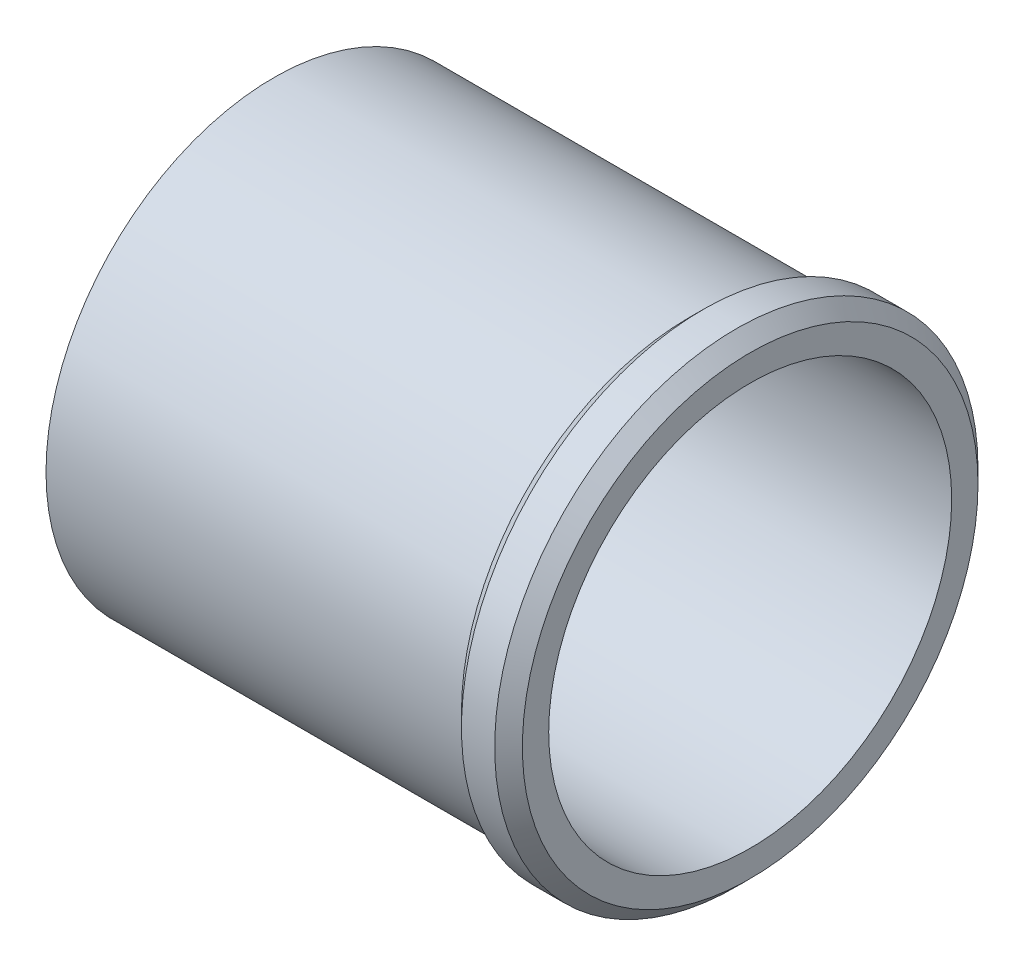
ISO-10303-21;
HEADER;
FILE_DESCRIPTION(('STEP AP214'),'2;1');
FILE_NAME('part.step','',(''),(''),'','','');
FILE_SCHEMA(('AUTOMOTIVE_DESIGN { 1 0 10303 214 1 1 1 1 }'));
ENDSEC;
DATA;
#1=APPLICATION_CONTEXT('core data for automotive mechanical design processes');
#2=APPLICATION_PROTOCOL_DEFINITION('international standard','automotive_design',2000,#1);
#3=PRODUCT_CONTEXT('',#1,'mechanical');
#4=PRODUCT('Part','Part','',(#3));
#5=PRODUCT_RELATED_PRODUCT_CATEGORY('part','',(#4));
#6=PRODUCT_DEFINITION_FORMATION('','',#4);
#7=PRODUCT_DEFINITION_CONTEXT('part definition',#1,'design');
#8=PRODUCT_DEFINITION('design','',#6,#7);
#9=PRODUCT_DEFINITION_SHAPE('','',#8);
#10=(LENGTH_UNIT() NAMED_UNIT(*) SI_UNIT(.MILLI.,.METRE.));
#11=(NAMED_UNIT(*) PLANE_ANGLE_UNIT() SI_UNIT($,.RADIAN.));
#12=(NAMED_UNIT(*) SI_UNIT($,.STERADIAN.) SOLID_ANGLE_UNIT());
#13=UNCERTAINTY_MEASURE_WITH_UNIT(LENGTH_MEASURE(1.E-05),#10,'distance_accuracy_value','');
#14=(GEOMETRIC_REPRESENTATION_CONTEXT(3) GLOBAL_UNCERTAINTY_ASSIGNED_CONTEXT((#13)) GLOBAL_UNIT_ASSIGNED_CONTEXT((#10,
#11,#12)) REPRESENTATION_CONTEXT('',''));
#15=CARTESIAN_POINT('',(0.,0.,0.));
#16=DIRECTION('',(0.,0.,1.));
#17=DIRECTION('',(1.,0.,0.));
#18=AXIS2_PLACEMENT_3D('',#15,#16,#17);
#19=CARTESIAN_POINT('',(0.,0.,0.));
#20=DIRECTION('',(1.,0.,0.));
#21=DIRECTION('',(0.,0.,-1.));
#22=AXIS2_PLACEMENT_3D('',#19,#20,#21);
#23=PLANE('',#22);
#24=CARTESIAN_POINT('',(0.,0.,0.));
#25=DIRECTION('',(1.,0.,0.));
#26=DIRECTION('',(0.,0.,-1.));
#27=AXIS2_PLACEMENT_3D('',#24,#25,#26);
#28=CIRCLE('',#27,4.1783);
#29=CARTESIAN_POINT('',(0.,0.,4.1783));
#30=VERTEX_POINT('',#29);
#31=EDGE_CURVE('E56',#30,#30,#28,.T.);
#32=ORIENTED_EDGE('',*,*,#31,.F.);
#33=EDGE_LOOP('',(#32));
#34=FACE_BOUND('',#33,.T.);
#35=CARTESIAN_POINT('',(0.,0.,0.));
#36=DIRECTION('',(1.,0.,0.));
#37=DIRECTION('',(0.,0.,-1.));
#38=AXIS2_PLACEMENT_3D('',#35,#36,#37);
#39=CIRCLE('',#38,3.4417);
#40=CARTESIAN_POINT('',(0.,0.,-3.4417));
#41=VERTEX_POINT('',#40);
#42=EDGE_CURVE('E46',#41,#41,#39,.T.);
#43=ORIENTED_EDGE('',*,*,#42,.T.);
#44=EDGE_LOOP('',(#43));
#45=FACE_BOUND('',#44,.T.);
#46=ADVANCED_FACE('F24',(#34,#45),#23,.F.);
#47=CARTESIAN_POINT('',(1.1176,0.,0.));
#48=DIRECTION('',(1.,0.,0.));
#49=DIRECTION('',(0.,0.,-1.));
#50=AXIS2_PLACEMENT_3D('',#47,#48,#49);
#51=PLANE('',#50);
#52=CARTESIAN_POINT('',(1.1176,0.,0.));
#53=DIRECTION('',(1.,0.,0.));
#54=DIRECTION('',(0.,0.,-1.));
#55=AXIS2_PLACEMENT_3D('',#52,#53,#54);
#56=CIRCLE('',#55,3.6957);
#57=CARTESIAN_POINT('',(1.1176,0.,-3.6957));
#58=VERTEX_POINT('',#57);
#59=EDGE_CURVE('E39',#58,#58,#56,.T.);
#60=ORIENTED_EDGE('',*,*,#59,.T.);
#61=EDGE_LOOP('',(#60));
#62=FACE_BOUND('',#61,.T.);
#63=CARTESIAN_POINT('',(1.1176,0.,0.));
#64=DIRECTION('',(1.,0.,0.));
#65=DIRECTION('',(0.,0.,-1.));
#66=AXIS2_PLACEMENT_3D('',#63,#64,#65);
#67=CIRCLE('',#66,3.4417);
#68=CARTESIAN_POINT('',(1.1176,0.,-3.4417));
#69=VERTEX_POINT('',#68);
#70=EDGE_CURVE('E42',#69,#69,#67,.F.);
#71=ORIENTED_EDGE('',*,*,#70,.T.);
#72=EDGE_LOOP('',(#71));
#73=FACE_BOUND('',#72,.T.);
#74=ADVANCED_FACE('F64',(#62,#73),#51,.T.);
#75=CARTESIAN_POINT('',(8.7376,0.,0.));
#76=DIRECTION('',(-1.,0.,0.));
#77=DIRECTION('',(0.,0.,1.));
#78=AXIS2_PLACEMENT_3D('',#75,#76,#77);
#79=CYLINDRICAL_SURFACE('',#78,4.4323);
#80=CARTESIAN_POINT('',(8.4836,0.,0.));
#81=DIRECTION('',(1.,0.,0.));
#82=DIRECTION('',(0.,0.,-1.));
#83=AXIS2_PLACEMENT_3D('',#80,#81,#82);
#84=CIRCLE('',#83,4.4323);
#85=CARTESIAN_POINT('',(8.4836,0.,-4.4323));
#86=VERTEX_POINT('',#85);
#87=EDGE_CURVE('E10',#86,#86,#84,.F.);
#88=ORIENTED_EDGE('',*,*,#87,.T.);
#89=EDGE_LOOP('',(#88));
#90=FACE_BOUND('',#89,.T.);
#91=CARTESIAN_POINT('',(7.874,0.,0.));
#92=DIRECTION('',(1.,0.,0.));
#93=DIRECTION('',(0.,0.,-1.));
#94=AXIS2_PLACEMENT_3D('',#91,#92,#93);
#95=CIRCLE('',#94,4.4323);
#96=CARTESIAN_POINT('',(7.874,0.,-4.4323));
#97=VERTEX_POINT('',#96);
#98=EDGE_CURVE('E31',#97,#97,#95,.T.);
#99=ORIENTED_EDGE('',*,*,#98,.T.);
#100=EDGE_LOOP('',(#99));
#101=FACE_BOUND('',#100,.T.);
#102=ADVANCED_FACE('F26',(#90,#101),#79,.T.);
#103=CARTESIAN_POINT('',(8.7376,0.,0.));
#104=DIRECTION('',(1.,0.,0.));
#105=DIRECTION('',(0.,0.,-1.));
#106=AXIS2_PLACEMENT_3D('',#103,#104,#105);
#107=PLANE('',#106);
#108=CARTESIAN_POINT('',(8.7376,0.,0.));
#109=DIRECTION('',(1.,0.,0.));
#110=DIRECTION('',(0.,0.,-1.));
#111=AXIS2_PLACEMENT_3D('',#108,#109,#110);
#112=CIRCLE('',#111,4.1783);
#113=CARTESIAN_POINT('',(8.7376,0.,-4.1783));
#114=VERTEX_POINT('',#113);
#115=EDGE_CURVE('E35',#114,#114,#112,.T.);
#116=ORIENTED_EDGE('',*,*,#115,.T.);
#117=EDGE_LOOP('',(#116));
#118=FACE_BOUND('',#117,.T.);
#119=CARTESIAN_POINT('',(8.7376,0.,0.));
#120=DIRECTION('',(1.,0.,0.));
#121=DIRECTION('',(0.,0.,-1.));
#122=AXIS2_PLACEMENT_3D('',#119,#120,#121);
#123=CIRCLE('',#122,3.6957);
#124=CARTESIAN_POINT('',(8.7376,0.,-3.6957));
#125=VERTEX_POINT('',#124);
#126=EDGE_CURVE('E45',#125,#125,#123,.T.);
#127=ORIENTED_EDGE('',*,*,#126,.F.);
#128=EDGE_LOOP('',(#127));
#129=FACE_BOUND('',#128,.T.);
#130=ADVANCED_FACE('F80',(#118,#129),#107,.T.);
#131=CARTESIAN_POINT('',(1.1176,0.,0.));
#132=DIRECTION('',(1.,0.,0.));
#133=DIRECTION('',(0.,0.,-1.));
#134=AXIS2_PLACEMENT_3D('',#131,#132,#133);
#135=CYLINDRICAL_SURFACE('',#134,3.6957);
#136=CARTESIAN_POINT('',(1.1176,0.,-3.6957));
#137=CARTESIAN_POINT('',(1.196975,0.,-3.6957));
#138=CARTESIAN_POINT('',(1.27635,0.,-3.6957));
#139=CARTESIAN_POINT('',(1.4351,0.,-3.6957));
#140=CARTESIAN_POINT('',(1.514475,0.,-3.6957));
#141=CARTESIAN_POINT('',(1.673225,0.,-3.6957));
#142=CARTESIAN_POINT('',(1.7526,0.,-3.6957));
#143=CARTESIAN_POINT('',(1.91135,0.,-3.6957));
#144=CARTESIAN_POINT('',(1.990725,0.,-3.6957));
#145=CARTESIAN_POINT('',(2.149475,0.,-3.6957));
#146=CARTESIAN_POINT('',(2.22885,0.,-3.6957));
#147=CARTESIAN_POINT('',(2.3876,0.,-3.6957));
#148=CARTESIAN_POINT('',(2.466975,0.,-3.6957));
#149=CARTESIAN_POINT('',(2.625725,0.,-3.6957));
#150=CARTESIAN_POINT('',(2.7051,0.,-3.6957));
#151=CARTESIAN_POINT('',(2.86385,0.,-3.6957));
#152=CARTESIAN_POINT('',(2.943225,0.,-3.6957));
#153=CARTESIAN_POINT('',(3.101975,0.,-3.6957));
#154=CARTESIAN_POINT('',(3.18135,0.,-3.6957));
#155=CARTESIAN_POINT('',(3.3401,0.,-3.6957));
#156=CARTESIAN_POINT('',(3.419475,0.,-3.6957));
#157=CARTESIAN_POINT('',(3.578225,0.,-3.6957));
#158=CARTESIAN_POINT('',(3.6576,0.,-3.6957));
#159=CARTESIAN_POINT('',(3.81635,0.,-3.6957));
#160=CARTESIAN_POINT('',(3.895725,0.,-3.6957));
#161=CARTESIAN_POINT('',(4.054475,0.,-3.6957));
#162=CARTESIAN_POINT('',(4.13385,0.,-3.6957));
#163=CARTESIAN_POINT('',(4.2926,0.,-3.6957));
#164=CARTESIAN_POINT('',(4.371975,0.,-3.6957));
#165=CARTESIAN_POINT('',(4.530725,0.,-3.6957));
#166=CARTESIAN_POINT('',(4.6101,0.,-3.6957));
#167=CARTESIAN_POINT('',(4.76885,0.,-3.6957));
#168=CARTESIAN_POINT('',(4.848225,0.,-3.6957));
#169=CARTESIAN_POINT('',(5.006975,0.,-3.6957));
#170=CARTESIAN_POINT('',(5.08635,0.,-3.6957));
#171=CARTESIAN_POINT('',(5.2451,0.,-3.6957));
#172=CARTESIAN_POINT('',(5.324475,0.,-3.6957));
#173=CARTESIAN_POINT('',(5.483225,0.,-3.6957));
#174=CARTESIAN_POINT('',(5.5626,0.,-3.6957));
#175=CARTESIAN_POINT('',(5.72135,0.,-3.6957));
#176=CARTESIAN_POINT('',(5.800725,0.,-3.6957));
#177=CARTESIAN_POINT('',(5.959475,0.,-3.6957));
#178=CARTESIAN_POINT('',(6.03885,0.,-3.6957));
#179=CARTESIAN_POINT('',(6.1976,0.,-3.6957));
#180=CARTESIAN_POINT('',(6.276975,0.,-3.6957));
#181=CARTESIAN_POINT('',(6.435725,0.,-3.6957));
#182=CARTESIAN_POINT('',(6.5151,0.,-3.6957));
#183=CARTESIAN_POINT('',(6.67385,0.,-3.6957));
#184=CARTESIAN_POINT('',(6.753225,0.,-3.6957));
#185=CARTESIAN_POINT('',(6.911975,0.,-3.6957));
#186=CARTESIAN_POINT('',(6.99135,0.,-3.6957));
#187=CARTESIAN_POINT('',(7.1501,0.,-3.6957));
#188=CARTESIAN_POINT('',(7.229475,0.,-3.6957));
#189=CARTESIAN_POINT('',(7.388225,0.,-3.6957));
#190=CARTESIAN_POINT('',(7.4676,0.,-3.6957));
#191=CARTESIAN_POINT('',(7.62635,0.,-3.6957));
#192=CARTESIAN_POINT('',(7.705725,0.,-3.6957));
#193=CARTESIAN_POINT('',(7.864475,0.,-3.6957));
#194=CARTESIAN_POINT('',(7.94385,0.,-3.6957));
#195=CARTESIAN_POINT('',(8.1026,0.,-3.6957));
#196=CARTESIAN_POINT('',(8.181975,0.,-3.6957));
#197=CARTESIAN_POINT('',(8.340725,0.,-3.6957));
#198=CARTESIAN_POINT('',(8.4201,0.,-3.6957));
#199=CARTESIAN_POINT('',(8.57885,0.,-3.6957));
#200=CARTESIAN_POINT('',(8.658225,0.,-3.6957));
#201=CARTESIAN_POINT('',(8.7376,0.,-3.6957));
#202=B_SPLINE_CURVE_WITH_KNOTS('',3,(#136,#137,#138,#139,#140,#141,#142,#143,#144,#145,#146,
#147,#148,#149,#150,#151,#152,#153,#154,#155,#156,#157,#158,#159,#160,#161,#162,#163,#164,#165,
#166,#167,#168,#169,#170,#171,#172,#173,#174,#175,#176,#177,#178,#179,#180,#181,#182,#183,#184,
#185,#186,#187,#188,#189,#190,#191,#192,#193,#194,#195,#196,#197,#198,#199,#200,#201),
.UNSPECIFIED.,.F.,.F.,(4,2,2,2,2,2,2,2,2,2,2,2,2,2,2,2,2,2,2,2,2,2,2,2,2,2,2,2,2,2,2,2,4),(0.,
0.238125,0.47625,0.714375,0.9525,1.190625,1.42875,1.666875,1.905,2.143125,2.38125,2.619375,
2.8575,3.095625,3.33375,3.571875,3.81,4.048125,4.28625,4.524375,4.7625,5.000625,5.23875,
5.476875,5.715,5.953125,6.19125,6.429375,6.6675,6.905625,7.14375,7.381875,7.62),.UNSPECIFIED.);
#203=EDGE_CURVE('BSEAM70',#58,#125,#202,.T.);
#204=ORIENTED_EDGE('',*,*,#59,.F.);
#205=ORIENTED_EDGE('',*,*,#126,.T.);
#206=ORIENTED_EDGE('',*,*,#203,.T.);
#207=ORIENTED_EDGE('',*,*,#203,.F.);
#208=EDGE_LOOP('',(#204,#206,#205,#207));
#209=FACE_BOUND('',#208,.T.);
#210=ADVANCED_FACE('F70',(#209),#135,.F.);
#211=CARTESIAN_POINT('',(8.7376,0.,0.));
#212=DIRECTION('',(-1.,0.,0.));
#213=DIRECTION('',(0.,0.,1.));
#214=AXIS2_PLACEMENT_3D('',#211,#212,#213);
#215=CYLINDRICAL_SURFACE('',#214,3.4417);
#216=ORIENTED_EDGE('',*,*,#70,.F.);
#217=EDGE_LOOP('',(#216));
#218=FACE_BOUND('',#217,.T.);
#219=ORIENTED_EDGE('',*,*,#42,.F.);
#220=EDGE_LOOP('',(#219));
#221=FACE_BOUND('',#220,.T.);
#222=ADVANCED_FACE('F68',(#218,#221),#215,.F.);
#223=CARTESIAN_POINT('',(7.62,0.,0.));
#224=DIRECTION('',(-1.,0.,0.));
#225=DIRECTION('',(0.,0.,1.));
#226=AXIS2_PLACEMENT_3D('',#223,#224,#225);
#227=CYLINDRICAL_SURFACE('',#226,4.1783);
#228=CARTESIAN_POINT('',(7.62,0.,0.));
#229=DIRECTION('',(1.,0.,0.));
#230=DIRECTION('',(0.,0.,-1.));
#231=AXIS2_PLACEMENT_3D('',#228,#229,#230);
#232=CIRCLE('',#231,4.1783);
#233=CARTESIAN_POINT('',(7.62,0.,4.1783));
#234=VERTEX_POINT('',#233);
#235=EDGE_CURVE('E53',#234,#234,#232,.T.);
#236=CARTESIAN_POINT('',(7.62,0.,4.1783));
#237=CARTESIAN_POINT('',(7.540625,0.,4.1783));
#238=CARTESIAN_POINT('',(7.46125,0.,4.1783));
#239=CARTESIAN_POINT('',(7.3025,0.,4.1783));
#240=CARTESIAN_POINT('',(7.223125,0.,4.1783));
#241=CARTESIAN_POINT('',(7.064375,0.,4.1783));
#242=CARTESIAN_POINT('',(6.985,0.,4.1783));
#243=CARTESIAN_POINT('',(6.82625,0.,4.1783));
#244=CARTESIAN_POINT('',(6.746875,0.,4.1783));
#245=CARTESIAN_POINT('',(6.588125,0.,4.1783));
#246=CARTESIAN_POINT('',(6.50875,0.,4.1783));
#247=CARTESIAN_POINT('',(6.35,0.,4.1783));
#248=CARTESIAN_POINT('',(6.270625,0.,4.1783));
#249=CARTESIAN_POINT('',(6.111875,0.,4.1783));
#250=CARTESIAN_POINT('',(6.0325,0.,4.1783));
#251=CARTESIAN_POINT('',(5.87375,0.,4.1783));
#252=CARTESIAN_POINT('',(5.794375,0.,4.1783));
#253=CARTESIAN_POINT('',(5.635625,0.,4.1783));
#254=CARTESIAN_POINT('',(5.55625,0.,4.1783));
#255=CARTESIAN_POINT('',(5.3975,0.,4.1783));
#256=CARTESIAN_POINT('',(5.318125,0.,4.1783));
#257=CARTESIAN_POINT('',(5.159375,0.,4.1783));
#258=CARTESIAN_POINT('',(5.08,0.,4.1783));
#259=CARTESIAN_POINT('',(4.92125,0.,4.1783));
#260=CARTESIAN_POINT('',(4.841875,0.,4.1783));
#261=CARTESIAN_POINT('',(4.683125,0.,4.1783));
#262=CARTESIAN_POINT('',(4.60375,0.,4.1783));
#263=CARTESIAN_POINT('',(4.445,0.,4.1783));
#264=CARTESIAN_POINT('',(4.365625,0.,4.1783));
#265=CARTESIAN_POINT('',(4.206875,0.,4.1783));
#266=CARTESIAN_POINT('',(4.1275,0.,4.1783));
#267=CARTESIAN_POINT('',(3.96875,0.,4.1783));
#268=CARTESIAN_POINT('',(3.889375,0.,4.1783));
#269=CARTESIAN_POINT('',(3.730625,0.,4.1783));
#270=CARTESIAN_POINT('',(3.65125,0.,4.1783));
#271=CARTESIAN_POINT('',(3.4925,0.,4.1783));
#272=CARTESIAN_POINT('',(3.413125,0.,4.1783));
#273=CARTESIAN_POINT('',(3.254375,0.,4.1783));
#274=CARTESIAN_POINT('',(3.175,0.,4.1783));
#275=CARTESIAN_POINT('',(3.01625,0.,4.1783));
#276=CARTESIAN_POINT('',(2.936875,0.,4.1783));
#277=CARTESIAN_POINT('',(2.778125,0.,4.1783));
#278=CARTESIAN_POINT('',(2.69875,0.,4.1783));
#279=CARTESIAN_POINT('',(2.54,0.,4.1783));
#280=CARTESIAN_POINT('',(2.460625,0.,4.1783));
#281=CARTESIAN_POINT('',(2.301875,0.,4.1783));
#282=CARTESIAN_POINT('',(2.2225,0.,4.1783));
#283=CARTESIAN_POINT('',(2.06375,0.,4.1783));
#284=CARTESIAN_POINT('',(1.984375,0.,4.1783));
#285=CARTESIAN_POINT('',(1.825625,0.,4.1783));
#286=CARTESIAN_POINT('',(1.74625,0.,4.1783));
#287=CARTESIAN_POINT('',(1.5875,0.,4.1783));
#288=CARTESIAN_POINT('',(1.508125,0.,4.1783));
#289=CARTESIAN_POINT('',(1.349375,0.,4.1783));
#290=CARTESIAN_POINT('',(1.27,0.,4.1783));
#291=CARTESIAN_POINT('',(1.11125,0.,4.1783));
#292=CARTESIAN_POINT('',(1.031875,0.,4.1783));
#293=CARTESIAN_POINT('',(0.873125,0.,4.1783));
#294=CARTESIAN_POINT('',(0.79375,0.,4.1783));
#295=CARTESIAN_POINT('',(0.635,0.,4.1783));
#296=CARTESIAN_POINT('',(0.555625,0.,4.1783));
#297=CARTESIAN_POINT('',(0.396875,0.,4.1783));
#298=CARTESIAN_POINT('',(0.3175,0.,4.1783));
#299=CARTESIAN_POINT('',(0.15875,0.,4.1783));
#300=CARTESIAN_POINT('',(0.0793749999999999,0.,4.1783));
#301=CARTESIAN_POINT('',(0.,0.,4.1783));
#302=B_SPLINE_CURVE_WITH_KNOTS('',3,(#236,#237,#238,#239,#240,#241,#242,#243,#244,#245,#246,
#247,#248,#249,#250,#251,#252,#253,#254,#255,#256,#257,#258,#259,#260,#261,#262,#263,#264,#265,
#266,#267,#268,#269,#270,#271,#272,#273,#274,#275,#276,#277,#278,#279,#280,#281,#282,#283,#284,
#285,#286,#287,#288,#289,#290,#291,#292,#293,#294,#295,#296,#297,#298,#299,#300,#301),
.UNSPECIFIED.,.F.,.F.,(4,2,2,2,2,2,2,2,2,2,2,2,2,2,2,2,2,2,2,2,2,2,2,2,2,2,2,2,2,2,2,2,4),(0.,
0.238125,0.476249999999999,0.714375,0.952499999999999,1.190625,1.42875,1.666875,1.905,2.143125,
2.38125,2.619375,2.8575,3.095625,3.33375,3.571875,3.81,4.048125,4.28625,4.524375,4.7625,
5.000625,5.23875,5.476875,5.715,5.953125,6.19125,6.429375,6.6675,6.905625,7.14375,7.381875,
7.62),.UNSPECIFIED.);
#303=EDGE_CURVE('BSEAM60',#234,#30,#302,.T.);
#304=ORIENTED_EDGE('',*,*,#235,.F.);
#305=ORIENTED_EDGE('',*,*,#31,.T.);
#306=ORIENTED_EDGE('',*,*,#303,.T.);
#307=ORIENTED_EDGE('',*,*,#303,.F.);
#308=EDGE_LOOP('',(#304,#306,#305,#307));
#309=FACE_BOUND('',#308,.T.);
#310=ADVANCED_FACE('F60',(#309),#227,.T.);
#311=CARTESIAN_POINT('',(8.7376,0.,0.));
#312=DIRECTION('',(-1.,0.,0.));
#313=DIRECTION('',(0.,0.,1.));
#314=AXIS2_PLACEMENT_3D('',#311,#312,#313);
#315=CONICAL_SURFACE('',#314,4.1783,0.785398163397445);
#316=ORIENTED_EDGE('',*,*,#87,.F.);
#317=EDGE_LOOP('',(#316));
#318=FACE_BOUND('',#317,.T.);
#319=ORIENTED_EDGE('',*,*,#115,.F.);
#320=EDGE_LOOP('',(#319));
#321=FACE_BOUND('',#320,.T.);
#322=ADVANCED_FACE('F77',(#318,#321),#315,.T.);
#323=CARTESIAN_POINT('',(7.874,0.,0.));
#324=DIRECTION('',(1.,0.,0.));
#325=DIRECTION('',(0.,0.,-1.));
#326=AXIS2_PLACEMENT_3D('',#323,#324,#325);
#327=CONICAL_SURFACE('',#326,4.4323,0.785398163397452);
#328=ORIENTED_EDGE('',*,*,#235,.T.);
#329=EDGE_LOOP('',(#328));
#330=FACE_BOUND('',#329,.T.);
#331=ORIENTED_EDGE('',*,*,#98,.F.);
#332=EDGE_LOOP('',(#331));
#333=FACE_BOUND('',#332,.T.);
#334=ADVANCED_FACE('F99',(#330,#333),#327,.T.);
#335=CLOSED_SHELL('',(#46,#74,#102,#130,#210,#222,#310,#322,#334));
#336=MANIFOLD_SOLID_BREP('B2',#335);
#337=ADVANCED_BREP_SHAPE_REPRESENTATION('',(#18,#336),#14);
#338=SHAPE_DEFINITION_REPRESENTATION(#9,#337);
ENDSEC;
END-ISO-10303-21;
